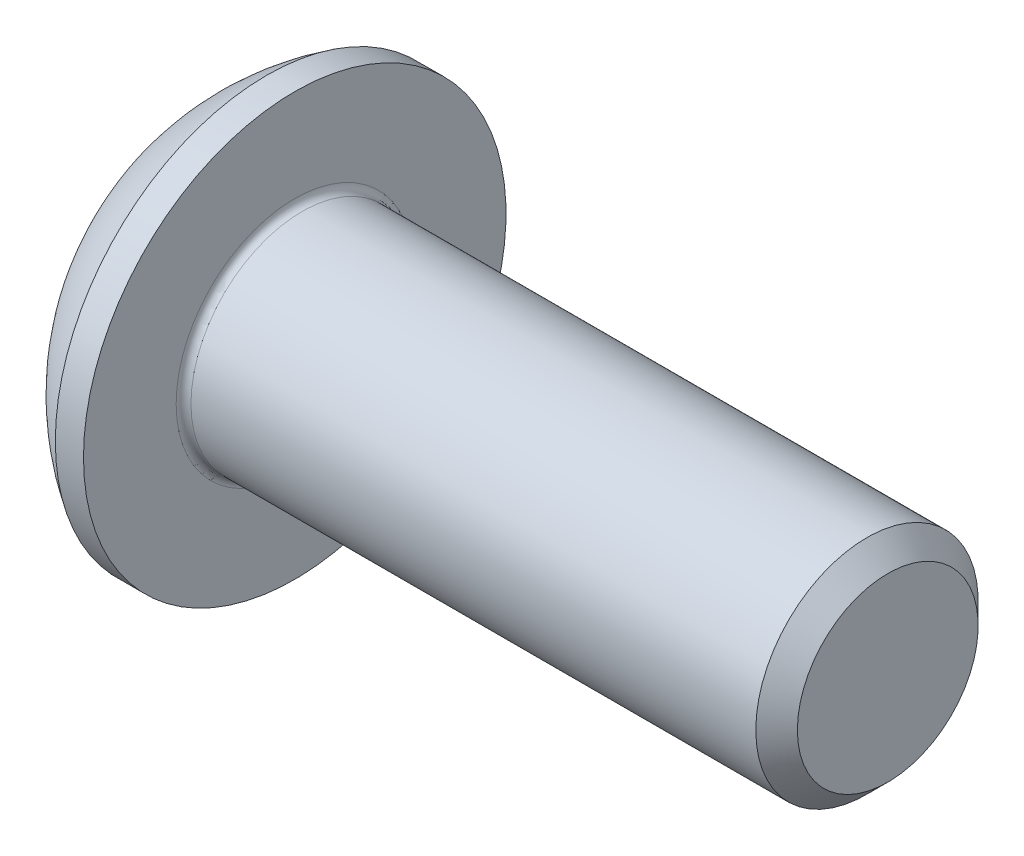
from build123d import *

# Parameters (mm, degrees)
FILLET1_R   = 0.1
HEX_2_DEPTH = 1.04


with BuildPart() as part:
    # BodySke → BaseBody (revolve)
    with BuildSketch(Plane.XY, mode=Mode.PRIVATE) as basebody_sk:
        with BuildLine():
            Line((9.65, 0), (9.65, 1.2195))
            Line((9.65, 1.2195), (9.3695, 1.5))
            Line((9.3695, 1.5), (1.65, 1.5))
            Line((1.65, 1.5), (1.65, 2.85))
            Line((1.65, 2.85), (1.27, 2.85))
            ThreePointArc((1.27, 2.85), (0.53140404, 2.229827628), (0, 1.425))
            Line((0, 1.425), (0, 0))
            Line((0, 0), (9.65, 0))
        make_face()
    revolve(basebody_sk.sketch.rotate(Axis((0, 0, 0), (1, 0, 0)), 90), axis=Axis((0, 0, 0), (1, 0, 0)))

    # Fillet1
    fillet1_edges = [part.edges().sort_by_distance(p)[0] for p in [
        (1.65, 0, -1.5),
    ]]
    fillet(fillet1_edges, radius=FILLET1_R)

    # Sketch2 → PreBroach (revolve, cut)
    with BuildSketch(Plane.XY, mode=Mode.PRIVATE) as prebroach_sk:
        Polygon((0, 1), (1.04, 1), (1.617350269, 0), (0, 0), align=None)
    revolve(prebroach_sk.sketch.rotate(Axis((0, 0, 0), (1, 0, 0)), 90), axis=Axis((0, 0, 0), (1, 0, 0)), mode=Mode.SUBTRACT)

    # Sketch3 → Hex 2 (cut)
    with BuildSketch(Plane(origin=(0, 0, 0), x_dir=(0, 0, -1), z_dir=(1, 0, 0))):
        Polygon((-1, -0.577350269), (-1, 0.577350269), (0, 1.154700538), (1, 0.577350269), (1, -0.577350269), (0, -1.154700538), align=None)
    extrude(amount=HEX_2_DEPTH, mode=Mode.SUBTRACT)


solid = part.part
